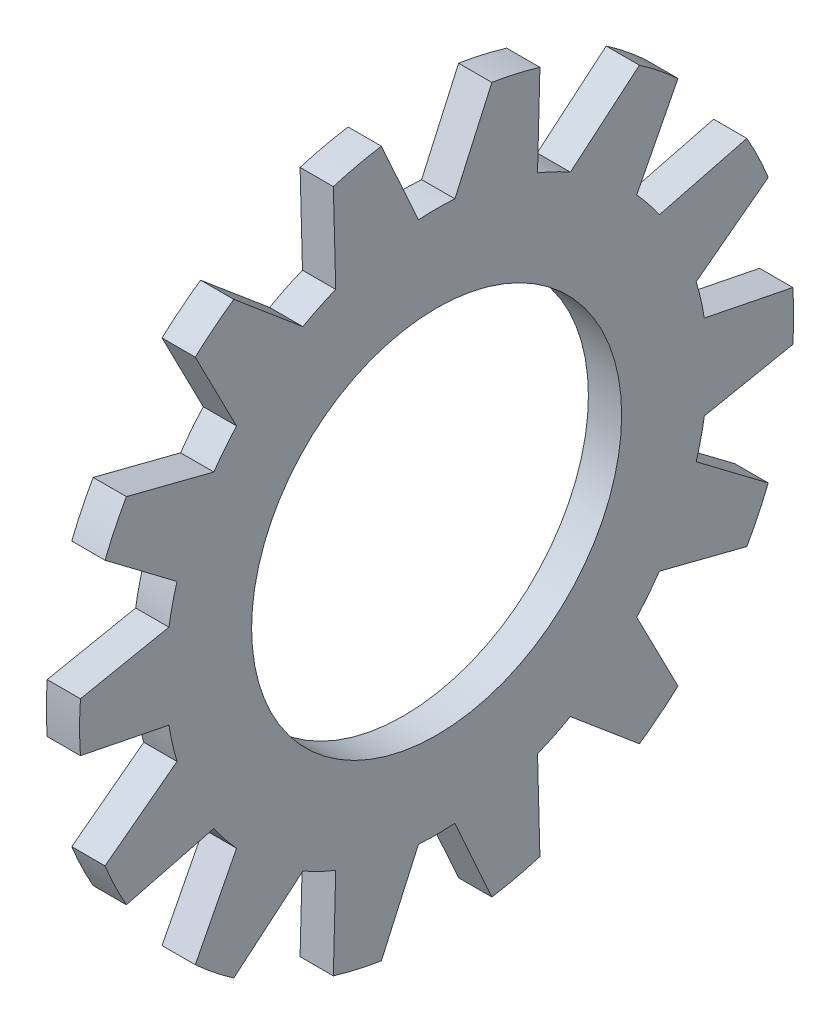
from build123d import *

# Parameters (mm, degrees)
SECSKE_W      = 0.5842
SECSKE_H      = 3.0226
EXTCUT_DEPTH  = 9.891705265
EXTCUTS_COUNT = 14
EXTCUTS_ANGLE = 334.285714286


with BuildPart() as part:
    # SecSke → Body (revolve)
    with BuildSketch(Plane.XY, mode=Mode.PRIVATE) as body_sk:
        with Locations((-0.2921, 4.7625)):
            Rectangle(SECSKE_W, SECSKE_H)
    revolve(body_sk.sketch.rotate(Axis((-34.925, 0, 0), (1, 0, 0)), 90), axis=Axis((-34.925, 0, 0), (1, 0, 0)))

    # ExtCutSke → ExtCut (cut, through all)
    with BuildSketch(Plane(origin=(0, 0, 0), x_dir=(0, 0, -1), z_dir=(1, 0, 0))):
        with BuildLine():
            Line((-1.103445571, 6.494415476), (-0.320368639, 4.751712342))
            ThreePointArc((-0.320368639, 4.751712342), (0, 4.7625), (0.320368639, 4.751712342))
            Line((0.320368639, 4.751712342), (1.103445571, 6.494415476))
            ThreePointArc((1.103445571, 6.494415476), (0, 6.58749), (-1.103445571, 6.494415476))
        make_face()
    extcut = extrude(amount=-EXTCUT_DEPTH, mode=Mode.SUBTRACT)

    # ExtCuts: ExtCut ×14 about axis
    extcuts_axis = Axis((-34.925, 0, 0), (1, 0, 0))
    for i in range(1, EXTCUTS_COUNT):
        add(extcut.rotate(extcuts_axis, i * EXTCUTS_ANGLE / (EXTCUTS_COUNT - 1)), mode=Mode.SUBTRACT)


solid = part.part
